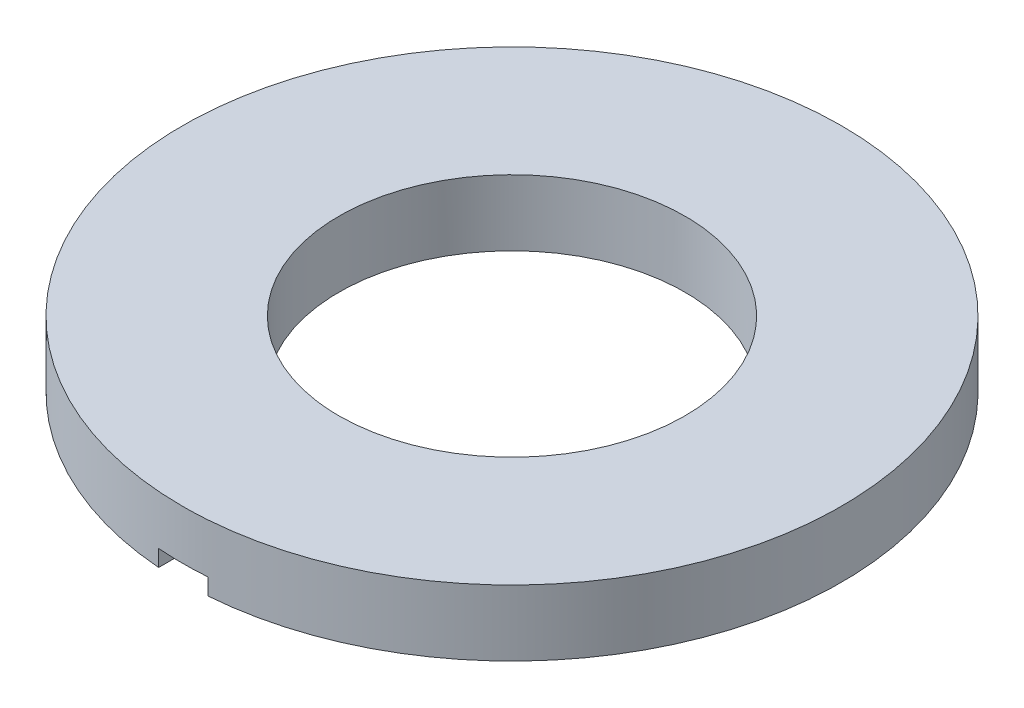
from build123d import *

# Parameters (mm, degrees)
SKETCH1_R          = 8
SKETCH1_R_2        = 4.2
EXTRUDE1_DEPTH     = 1.6
SKETCH2_W          = 1.2
SKETCH2_H          = 7.6
CUT_EXTRUDE1_DEPTH = 0.4


with BuildPart() as part:
    # Sketch1 → Extrude1 (new body)
    with BuildSketch(Plane(origin=(0, 0, 0), x_dir=(1, 0, 0), z_dir=(0, 1, 0))):
        with Locations(Location((0, 0, 0), (0, 0, 270))):
            Circle(SKETCH1_R)
        with Locations(Location((0, 0, 0), (0, 0, 270))):
            Circle(SKETCH1_R_2, mode=Mode.SUBTRACT)
    extrude(amount=EXTRUDE1_DEPTH)

    # Sketch2 → Cut-Extrude1 (cut)
    with BuildSketch(Plane.XZ):
        with Locations((0, 4.2)):
            Rectangle(SKETCH2_W, SKETCH2_H)
    extrude(amount=-CUT_EXTRUDE1_DEPTH, mode=Mode.SUBTRACT)


solid = part.part
